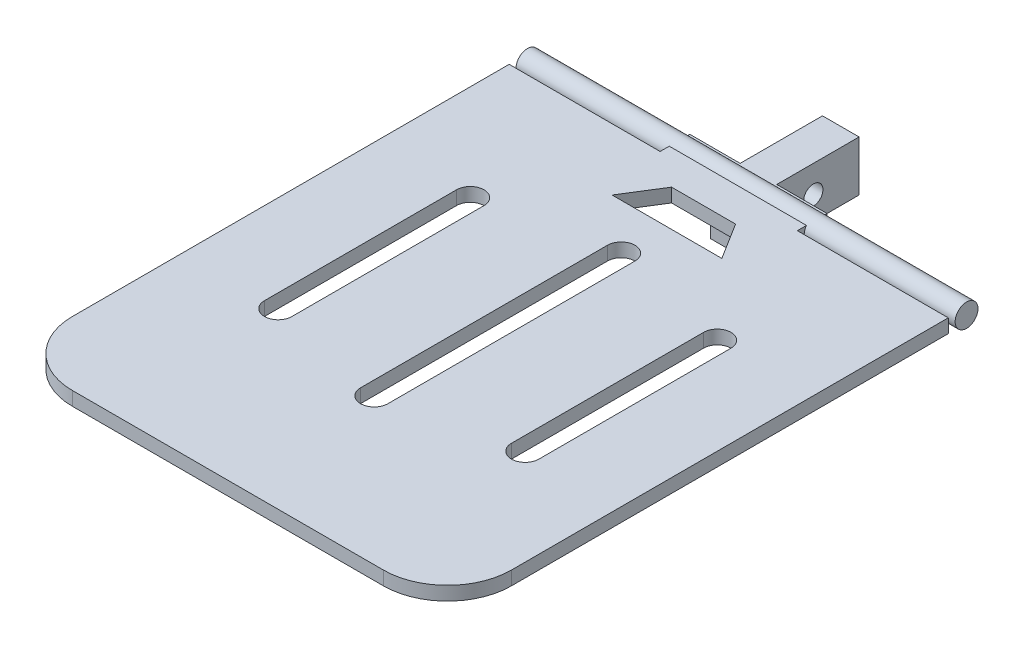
from build123d import *
from build123d.topology import SkipClean

# Parameters (mm, degrees)
F_01_PLATE_BODY_DEPTH   = 1.5
SKETCH_2_R              = 2.5
F_02_EDGE_BEAD_D5_DEPTH = 48
SKETCH_3_W              = 30
SKETCH_3_H              = 8
F_03_WEB_DEPTH          = 1.5
SKETCH_4_W              = 8
SKETCH_4_H              = 24.5
F_04_TAB_DEPTH          = 5.5
F_05_SLOT_1_F_DEPTH     = 134.305101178
F_05_SLOT_1_B_DEPTH     = 134.305101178
F_05_SLOT_2_F_DEPTH     = 134.305101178
F_05_SLOT_2_B_DEPTH     = 134.305101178
F_05_SLOT_3_F_DEPTH     = 134.305101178
F_05_SLOT_3_B_DEPTH     = 134.305101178
F_06_WINDOW_F_DEPTH     = 134.305101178
F_06_WINDOW_B_DEPTH     = 134.305101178
SKETCH_13_R             = 2.1
F_07_PINHOLE_R_DEPTH    = 134.150291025
SKETCH_14_R             = 2.1
F_07_PINHOLE_L_DEPTH    = 134.150291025


with BuildPart() as part:
    # Sketch 1 → 01_PLATE_BODY (new, symmetric)
    with BuildSketch(Plane(origin=(0, 4.5, 0), x_dir=(1, 0, 0), z_dir=(0, 1, 0))):
        with BuildLine():
            Line((-48, -14.5), (48, -14.5))
            Line((48, -14.5), (48, -110))
            ThreePointArc((48, -110), (43.899494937, -119.899494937), (34, -124))
            Line((34, -124), (-34, -124))
            ThreePointArc((-34, -124), (-43.899494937, -119.899494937), (-48, -110))
            Line((-48, -110), (-48, -14.5))
        make_face()
    extrude(amount=F_01_PLATE_BODY_DEPTH, both=True)



with BuildPart() as body_2:
    # Sketch 2 → 02_EDGE_BEAD_D5 (new, symmetric)
    with BuildSketch(Plane(origin=(0, 0, 0), x_dir=(0, 0, -1), z_dir=(1, 0, 0))):
        with Locations((-10.5, 4.5)):
            Circle(SKETCH_2_R)
    extrude(amount=F_02_EDGE_BEAD_D5_DEPTH, both=True)


with BuildPart() as part_1:
    add(part.part)

    add(body_2.part)  # 03_WEB merges body 2
    # Sketch 3 → 03_WEB (add, symmetric)
    with BuildSketch(Plane(origin=(0, 4.5, 0), x_dir=(1, 0, 0), z_dir=(0, 1, 0))):
        with Locations((0, -12)):
            Rectangle(SKETCH_3_W, SKETCH_3_H)
    extrude(amount=F_03_WEB_DEPTH, both=True)

    # Sketch 4 → 04_TAB (add, symmetric)
    with BuildSketch(Plane(origin=(0, 0.5, 0), x_dir=(1, 0, 0), z_dir=(0, 1, 0))):
        with Locations((0, -2.25)):
            Rectangle(SKETCH_4_W, SKETCH_4_H)
    extrude(amount=F_04_TAB_DEPTH, both=True)

    # Sketch 5 → 05_SLOT_1_F (cut, through all)
    with BuildSketch(Plane(origin=(0, 4.5, 0), x_dir=(1, 0, 0), z_dir=(0, 1, 0))):
        with BuildLine():
            Line((3, -38), (3, -92))
            ThreePointArc((3, -92), (0, -95), (-3, -92))
            Line((-3, -92), (-3, -38))
            ThreePointArc((-3, -38), (0, -35), (3, -38))
        make_face()
    extrude(amount=F_05_SLOT_1_F_DEPTH, mode=Mode.SUBTRACT)

    # Sketch 6 → 05_SLOT_1_B (cut, through all)
    with BuildSketch(Plane(origin=(0, 4.5, 0), x_dir=(1, 0, 0), z_dir=(0, 1, 0))):
        with BuildLine():
            Line((3, -38), (3, -92))
            ThreePointArc((3, -92), (0, -95), (-3, -92))
            Line((-3, -92), (-3, -38))
            ThreePointArc((-3, -38), (0, -35), (3, -38))
        make_face()
    extrude(amount=-F_05_SLOT_1_B_DEPTH, mode=Mode.SUBTRACT)

    # Sketch 7 → 05_SLOT_2_F (cut, through all)
    with BuildSketch(Plane(origin=(0, 4.5, 0), x_dir=(1, 0, 0), z_dir=(0, 1, 0))):
        with BuildLine():
            Line((-24, -44), (-24, -86))
            ThreePointArc((-24, -86), (-27, -89), (-30, -86))
            Line((-30, -86), (-30, -44))
            ThreePointArc((-30, -44), (-27, -41), (-24, -44))
        make_face()
    extrude(amount=F_05_SLOT_2_F_DEPTH, mode=Mode.SUBTRACT)

    # Sketch 8 → 05_SLOT_2_B (cut, through all)
    with BuildSketch(Plane(origin=(0, 4.5, 0), x_dir=(1, 0, 0), z_dir=(0, 1, 0))):
        with BuildLine():
            Line((-24, -44), (-24, -86))
            ThreePointArc((-24, -86), (-27, -89), (-30, -86))
            Line((-30, -86), (-30, -44))
            ThreePointArc((-30, -44), (-27, -41), (-24, -44))
        make_face()
    extrude(amount=-F_05_SLOT_2_B_DEPTH, mode=Mode.SUBTRACT)

    # Sketch 9 → 05_SLOT_3_F (cut, through all)
    with BuildSketch(Plane(origin=(0, 4.5, 0), x_dir=(1, 0, 0), z_dir=(0, 1, 0))):
        with BuildLine():
            Line((30, -44), (30, -86))
            ThreePointArc((30, -86), (27, -89), (24, -86))
            Line((24, -86), (24, -44))
            ThreePointArc((24, -44), (27, -41), (30, -44))
        make_face()
    extrude(amount=F_05_SLOT_3_F_DEPTH, mode=Mode.SUBTRACT)

    # Sketch 10 → 05_SLOT_3_B (cut, through all)
    with BuildSketch(Plane(origin=(0, 4.5, 0), x_dir=(1, 0, 0), z_dir=(0, 1, 0))):
        with BuildLine():
            Line((30, -44), (30, -86))
            ThreePointArc((30, -86), (27, -89), (24, -86))
            Line((24, -86), (24, -44))
            ThreePointArc((24, -44), (27, -41), (30, -44))
        make_face()
    extrude(amount=-F_05_SLOT_3_B_DEPTH, mode=Mode.SUBTRACT)

    # Sketch 11 → 06_WINDOW_F (cut, through all)
    with BuildSketch(Plane(origin=(0, 4.5, 0), x_dir=(1, 0, 0), z_dir=(0, 1, 0))):
        Polygon((-7, -20), (7, -20), (12, -28), (-12, -28), align=None)
    extrude(amount=F_06_WINDOW_F_DEPTH, mode=Mode.SUBTRACT)

    # Sketch 12 → 06_WINDOW_B (cut, through all)
    with BuildSketch(Plane(origin=(0, 4.5, 0), x_dir=(1, 0, 0), z_dir=(0, 1, 0))):
        Polygon((-7, -20), (7, -20), (12, -28), (-12, -28), align=None)
    extrude(amount=-F_06_WINDOW_B_DEPTH, mode=Mode.SUBTRACT)

    # Sketch 13 → 07_PINHOLE_R (cut, through all)
    with BuildSketch(Plane(origin=(0, 0, 0), x_dir=(0, 0, -1), z_dir=(1, 0, 0))):
        Circle(SKETCH_13_R)
    extrude(amount=F_07_PINHOLE_R_DEPTH, mode=Mode.SUBTRACT)

    # Sketch 14 → 07_PINHOLE_L (cut, through all)
    with SkipClean():  # the faces are left unmerged after this step: merging them gives an invalid solid
        with BuildSketch(Plane(origin=(0, 0, 0), x_dir=(0, 0, -1), z_dir=(1, 0, 0))):
            with Locations(Location((0, 0, 0), (0, 0, 180))):
                Circle(SKETCH_14_R)
        extrude(amount=-F_07_PINHOLE_L_DEPTH, mode=Mode.SUBTRACT)


solid = part_1.part
